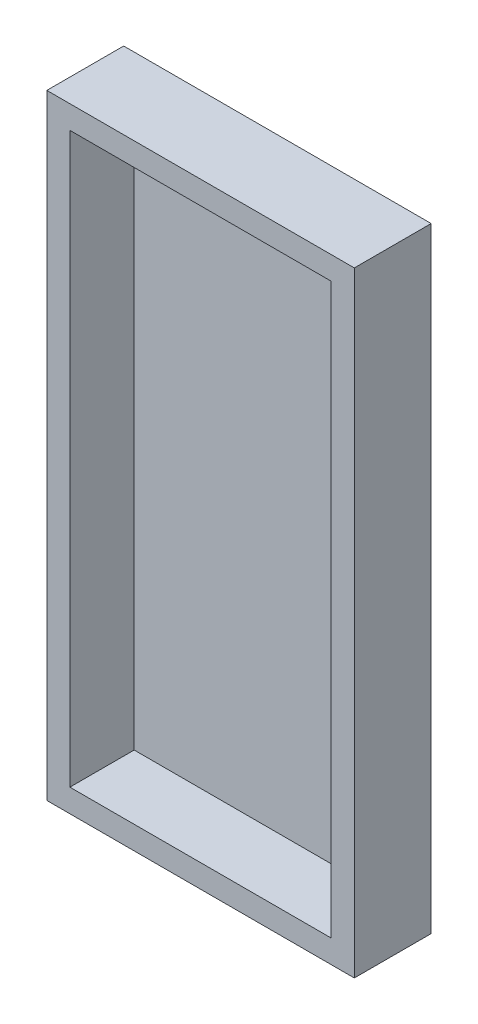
ISO-10303-21;
HEADER;
FILE_DESCRIPTION(('STEP AP214'),'2;1');
FILE_NAME('part.step','',(''),(''),'','','');
FILE_SCHEMA(('AUTOMOTIVE_DESIGN { 1 0 10303 214 1 1 1 1 }'));
ENDSEC;
DATA;
#1=APPLICATION_CONTEXT('core data for automotive mechanical design processes');
#2=APPLICATION_PROTOCOL_DEFINITION('international standard','automotive_design',2000,#1);
#3=PRODUCT_CONTEXT('',#1,'mechanical');
#4=PRODUCT('Part','Part','',(#3));
#5=PRODUCT_RELATED_PRODUCT_CATEGORY('part','',(#4));
#6=PRODUCT_DEFINITION_FORMATION('','',#4);
#7=PRODUCT_DEFINITION_CONTEXT('part definition',#1,'design');
#8=PRODUCT_DEFINITION('design','',#6,#7);
#9=PRODUCT_DEFINITION_SHAPE('','',#8);
#10=(LENGTH_UNIT() NAMED_UNIT(*) SI_UNIT(.MILLI.,.METRE.));
#11=(NAMED_UNIT(*) PLANE_ANGLE_UNIT() SI_UNIT($,.RADIAN.));
#12=(NAMED_UNIT(*) SI_UNIT($,.STERADIAN.) SOLID_ANGLE_UNIT());
#13=UNCERTAINTY_MEASURE_WITH_UNIT(LENGTH_MEASURE(1.E-05),#10,'distance_accuracy_value','');
#14=(GEOMETRIC_REPRESENTATION_CONTEXT(3) GLOBAL_UNCERTAINTY_ASSIGNED_CONTEXT((#13)) GLOBAL_UNIT_ASSIGNED_CONTEXT((#10,
#11,#12)) REPRESENTATION_CONTEXT('',''));
#15=CARTESIAN_POINT('',(0.,0.,0.));
#16=DIRECTION('',(0.,0.,1.));
#17=DIRECTION('',(1.,0.,0.));
#18=AXIS2_PLACEMENT_3D('',#15,#16,#17);
#19=CARTESIAN_POINT('',(-20.,-40.,-2.));
#20=DIRECTION('',(-1.,0.,0.));
#21=DIRECTION('',(0.,0.,1.));
#22=AXIS2_PLACEMENT_3D('',#19,#20,#21);
#23=PLANE('',#22);
#24=DIRECTION('',(0.,0.,1.));
#25=VECTOR('',#24,1.);
#26=CARTESIAN_POINT('',(-20.,-40.,-2.));
#27=LINE('',#26,#25);
#28=CARTESIAN_POINT('',(-20.,-40.,-2.));
#29=VERTEX_POINT('',#28);
#30=CARTESIAN_POINT('',(-20.,-40.,8.));
#31=VERTEX_POINT('',#30);
#32=EDGE_CURVE('E44',#29,#31,#27,.T.);
#33=ORIENTED_EDGE('',*,*,#32,.T.);
#34=DIRECTION('',(0.,-1.,0.));
#35=VECTOR('',#34,1.);
#36=CARTESIAN_POINT('',(-20.,-40.,8.));
#37=LINE('',#36,#35);
#38=CARTESIAN_POINT('',(-20.,40.,8.));
#39=VERTEX_POINT('',#38);
#40=EDGE_CURVE('E141',#39,#31,#37,.T.);
#41=ORIENTED_EDGE('',*,*,#40,.F.);
#42=DIRECTION('',(0.,0.,1.));
#43=VECTOR('',#42,1.);
#44=CARTESIAN_POINT('',(-20.,40.,-2.));
#45=LINE('',#44,#43);
#46=CARTESIAN_POINT('',(-20.,40.,-2.));
#47=VERTEX_POINT('',#46);
#48=EDGE_CURVE('E11',#47,#39,#45,.T.);
#49=ORIENTED_EDGE('',*,*,#48,.F.);
#50=DIRECTION('',(0.,-1.,0.));
#51=VECTOR('',#50,1.);
#52=CARTESIAN_POINT('',(-20.,-40.,-2.));
#53=LINE('',#52,#51);
#54=EDGE_CURVE('E156',#47,#29,#53,.T.);
#55=ORIENTED_EDGE('',*,*,#54,.T.);
#56=EDGE_LOOP('',(#33,#41,#49,#55));
#57=FACE_BOUND('',#56,.T.);
#58=ADVANCED_FACE('F41',(#57),#23,.T.);
#59=CARTESIAN_POINT('',(20.,40.,-2.));
#60=DIRECTION('',(0.,1.,0.));
#61=DIRECTION('',(0.,0.,1.));
#62=AXIS2_PLACEMENT_3D('',#59,#60,#61);
#63=PLANE('',#62);
#64=ORIENTED_EDGE('',*,*,#48,.T.);
#65=DIRECTION('',(-1.,0.,0.));
#66=VECTOR('',#65,1.);
#67=CARTESIAN_POINT('',(20.,40.,8.));
#68=LINE('',#67,#66);
#69=CARTESIAN_POINT('',(20.,40.,8.));
#70=VERTEX_POINT('',#69);
#71=EDGE_CURVE('E153',#70,#39,#68,.T.);
#72=ORIENTED_EDGE('',*,*,#71,.F.);
#73=DIRECTION('',(0.,0.,1.));
#74=VECTOR('',#73,1.);
#75=CARTESIAN_POINT('',(20.,40.,-2.));
#76=LINE('',#75,#74);
#77=CARTESIAN_POINT('',(20.,40.,-2.));
#78=VERTEX_POINT('',#77);
#79=EDGE_CURVE('E49',#78,#70,#76,.T.);
#80=ORIENTED_EDGE('',*,*,#79,.F.);
#81=DIRECTION('',(-1.,0.,0.));
#82=VECTOR('',#81,1.);
#83=CARTESIAN_POINT('',(20.,40.,-2.));
#84=LINE('',#83,#82);
#85=EDGE_CURVE('E164',#78,#47,#84,.T.);
#86=ORIENTED_EDGE('',*,*,#85,.T.);
#87=EDGE_LOOP('',(#64,#72,#80,#86));
#88=FACE_BOUND('',#87,.T.);
#89=ADVANCED_FACE('F177',(#88),#63,.T.);
#90=CARTESIAN_POINT('',(20.,-40.,-2.));
#91=DIRECTION('',(1.,0.,0.));
#92=DIRECTION('',(0.,0.,-1.));
#93=AXIS2_PLACEMENT_3D('',#90,#91,#92);
#94=PLANE('',#93);
#95=ORIENTED_EDGE('',*,*,#79,.T.);
#96=DIRECTION('',(0.,1.,0.));
#97=VECTOR('',#96,1.);
#98=CARTESIAN_POINT('',(20.,-40.,8.));
#99=LINE('',#98,#97);
#100=CARTESIAN_POINT('',(20.,-40.,8.));
#101=VERTEX_POINT('',#100);
#102=EDGE_CURVE('E150',#101,#70,#99,.T.);
#103=ORIENTED_EDGE('',*,*,#102,.F.);
#104=DIRECTION('',(0.,0.,1.));
#105=VECTOR('',#104,1.);
#106=CARTESIAN_POINT('',(20.,-40.,-2.));
#107=LINE('',#106,#105);
#108=CARTESIAN_POINT('',(20.,-40.,-2.));
#109=VERTEX_POINT('',#108);
#110=EDGE_CURVE('E167',#109,#101,#107,.T.);
#111=ORIENTED_EDGE('',*,*,#110,.F.);
#112=DIRECTION('',(0.,1.,0.));
#113=VECTOR('',#112,1.);
#114=CARTESIAN_POINT('',(20.,-40.,-2.));
#115=LINE('',#114,#113);
#116=EDGE_CURVE('E161',#109,#78,#115,.T.);
#117=ORIENTED_EDGE('',*,*,#116,.T.);
#118=EDGE_LOOP('',(#95,#103,#111,#117));
#119=FACE_BOUND('',#118,.T.);
#120=ADVANCED_FACE('F183',(#119),#94,.T.);
#121=CARTESIAN_POINT('',(20.,-40.,-2.));
#122=DIRECTION('',(0.,-1.,0.));
#123=DIRECTION('',(1.,0.,0.));
#124=AXIS2_PLACEMENT_3D('',#121,#122,#123);
#125=PLANE('',#124);
#126=ORIENTED_EDGE('',*,*,#110,.T.);
#127=DIRECTION('',(1.,0.,0.));
#128=VECTOR('',#127,1.);
#129=CARTESIAN_POINT('',(20.,-40.,8.));
#130=LINE('',#129,#128);
#131=EDGE_CURVE('E147',#31,#101,#130,.T.);
#132=ORIENTED_EDGE('',*,*,#131,.F.);
#133=ORIENTED_EDGE('',*,*,#32,.F.);
#134=DIRECTION('',(1.,0.,0.));
#135=VECTOR('',#134,1.);
#136=CARTESIAN_POINT('',(20.,-40.,-2.));
#137=LINE('',#136,#135);
#138=EDGE_CURVE('E158',#29,#109,#137,.T.);
#139=ORIENTED_EDGE('',*,*,#138,.T.);
#140=EDGE_LOOP('',(#126,#132,#133,#139));
#141=FACE_BOUND('',#140,.T.);
#142=ADVANCED_FACE('F171',(#141),#125,.T.);
#143=CARTESIAN_POINT('',(0.,0.,-2.));
#144=DIRECTION('',(0.,0.,1.));
#145=DIRECTION('',(1.,0.,0.));
#146=AXIS2_PLACEMENT_3D('',#143,#144,#145);
#147=PLANE('',#146);
#148=ORIENTED_EDGE('',*,*,#54,.F.);
#149=ORIENTED_EDGE('',*,*,#85,.F.);
#150=ORIENTED_EDGE('',*,*,#116,.F.);
#151=ORIENTED_EDGE('',*,*,#138,.F.);
#152=EDGE_LOOP('',(#148,#149,#150,#151));
#153=FACE_BOUND('',#152,.T.);
#154=ADVANCED_FACE('F181',(#153),#147,.F.);
#155=CARTESIAN_POINT('',(0.,0.,8.));
#156=DIRECTION('',(0.,0.,1.));
#157=DIRECTION('',(1.,0.,0.));
#158=AXIS2_PLACEMENT_3D('',#155,#156,#157);
#159=PLANE('',#158);
#160=DIRECTION('',(0.,-1.,0.));
#161=VECTOR('',#160,1.);
#162=CARTESIAN_POINT('',(-17.,-37.,8.));
#163=LINE('',#162,#161);
#164=CARTESIAN_POINT('',(-17.,37.,8.));
#165=VERTEX_POINT('',#164);
#166=CARTESIAN_POINT('',(-17.,-37.,8.));
#167=VERTEX_POINT('',#166);
#168=EDGE_CURVE('E57',#165,#167,#163,.T.);
#169=ORIENTED_EDGE('',*,*,#168,.F.);
#170=DIRECTION('',(-1.,0.,0.));
#171=VECTOR('',#170,1.);
#172=CARTESIAN_POINT('',(17.,37.,8.));
#173=LINE('',#172,#171);
#174=CARTESIAN_POINT('',(17.,37.,8.));
#175=VERTEX_POINT('',#174);
#176=EDGE_CURVE('E126',#175,#165,#173,.T.);
#177=ORIENTED_EDGE('',*,*,#176,.F.);
#178=DIRECTION('',(0.,1.,0.));
#179=VECTOR('',#178,1.);
#180=CARTESIAN_POINT('',(17.,-37.,8.));
#181=LINE('',#180,#179);
#182=CARTESIAN_POINT('',(17.,-37.,8.));
#183=VERTEX_POINT('',#182);
#184=EDGE_CURVE('E129',#183,#175,#181,.T.);
#185=ORIENTED_EDGE('',*,*,#184,.F.);
#186=DIRECTION('',(1.,0.,0.));
#187=VECTOR('',#186,1.);
#188=CARTESIAN_POINT('',(17.,-37.,8.));
#189=LINE('',#188,#187);
#190=EDGE_CURVE('E135',#167,#183,#189,.T.);
#191=ORIENTED_EDGE('',*,*,#190,.F.);
#192=EDGE_LOOP('',(#169,#177,#185,#191));
#193=FACE_BOUND('',#192,.T.);
#194=ORIENTED_EDGE('',*,*,#40,.T.);
#195=ORIENTED_EDGE('',*,*,#131,.T.);
#196=ORIENTED_EDGE('',*,*,#102,.T.);
#197=ORIENTED_EDGE('',*,*,#71,.T.);
#198=EDGE_LOOP('',(#194,#195,#196,#197));
#199=FACE_BOUND('',#198,.T.);
#200=ADVANCED_FACE('F174',(#193,#199),#159,.T.);
#201=CARTESIAN_POINT('',(-17.,-37.,-0.363170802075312));
#202=DIRECTION('',(-1.,0.,0.));
#203=DIRECTION('',(0.,0.,1.));
#204=AXIS2_PLACEMENT_3D('',#201,#202,#203);
#205=PLANE('',#204);
#206=ORIENTED_EDGE('',*,*,#168,.T.);
#207=DIRECTION('',(0.,0.,1.));
#208=VECTOR('',#207,1.);
#209=CARTESIAN_POINT('',(-17.,-37.,-0.363170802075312));
#210=LINE('',#209,#208);
#211=CARTESIAN_POINT('',(-17.,-37.,-0.363170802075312));
#212=VERTEX_POINT('',#211);
#213=EDGE_CURVE('E104',#212,#167,#210,.T.);
#214=ORIENTED_EDGE('',*,*,#213,.F.);
#215=DIRECTION('',(0.,-1.,0.));
#216=VECTOR('',#215,1.);
#217=CARTESIAN_POINT('',(-17.,-37.,-0.363170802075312));
#218=LINE('',#217,#216);
#219=CARTESIAN_POINT('',(-17.,37.,-0.363170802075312));
#220=VERTEX_POINT('',#219);
#221=EDGE_CURVE('E108',#220,#212,#218,.T.);
#222=ORIENTED_EDGE('',*,*,#221,.F.);
#223=DIRECTION('',(0.,0.,1.));
#224=VECTOR('',#223,1.);
#225=CARTESIAN_POINT('',(-17.,37.,-0.363170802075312));
#226=LINE('',#225,#224);
#227=EDGE_CURVE('E139',#220,#165,#226,.T.);
#228=ORIENTED_EDGE('',*,*,#227,.T.);
#229=EDGE_LOOP('',(#206,#214,#222,#228));
#230=FACE_BOUND('',#229,.T.);
#231=ADVANCED_FACE('F106',(#230),#205,.F.);
#232=CARTESIAN_POINT('',(17.,37.,-0.363170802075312));
#233=DIRECTION('',(0.,1.,0.));
#234=DIRECTION('',(0.,0.,1.));
#235=AXIS2_PLACEMENT_3D('',#232,#233,#234);
#236=PLANE('',#235);
#237=ORIENTED_EDGE('',*,*,#176,.T.);
#238=ORIENTED_EDGE('',*,*,#227,.F.);
#239=DIRECTION('',(-1.,0.,0.));
#240=VECTOR('',#239,1.);
#241=CARTESIAN_POINT('',(17.,37.,-0.363170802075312));
#242=LINE('',#241,#240);
#243=CARTESIAN_POINT('',(17.,37.,-0.363170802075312));
#244=VERTEX_POINT('',#243);
#245=EDGE_CURVE('E114',#244,#220,#242,.T.);
#246=ORIENTED_EDGE('',*,*,#245,.F.);
#247=DIRECTION('',(0.,0.,1.));
#248=VECTOR('',#247,1.);
#249=CARTESIAN_POINT('',(17.,37.,-0.363170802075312));
#250=LINE('',#249,#248);
#251=EDGE_CURVE('E142',#244,#175,#250,.T.);
#252=ORIENTED_EDGE('',*,*,#251,.T.);
#253=EDGE_LOOP('',(#237,#238,#246,#252));
#254=FACE_BOUND('',#253,.T.);
#255=ADVANCED_FACE('F239',(#254),#236,.F.);
#256=CARTESIAN_POINT('',(17.,-37.,-0.363170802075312));
#257=DIRECTION('',(1.,0.,0.));
#258=DIRECTION('',(0.,0.,-1.));
#259=AXIS2_PLACEMENT_3D('',#256,#257,#258);
#260=PLANE('',#259);
#261=ORIENTED_EDGE('',*,*,#184,.T.);
#262=ORIENTED_EDGE('',*,*,#251,.F.);
#263=DIRECTION('',(0.,1.,0.));
#264=VECTOR('',#263,1.);
#265=CARTESIAN_POINT('',(17.,-37.,-0.363170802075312));
#266=LINE('',#265,#264);
#267=CARTESIAN_POINT('',(17.,-37.,-0.363170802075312));
#268=VERTEX_POINT('',#267);
#269=EDGE_CURVE('E122',#268,#244,#266,.T.);
#270=ORIENTED_EDGE('',*,*,#269,.F.);
#271=DIRECTION('',(0.,0.,1.));
#272=VECTOR('',#271,1.);
#273=CARTESIAN_POINT('',(17.,-37.,-0.363170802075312));
#274=LINE('',#273,#272);
#275=EDGE_CURVE('E113',#268,#183,#274,.T.);
#276=ORIENTED_EDGE('',*,*,#275,.T.);
#277=EDGE_LOOP('',(#261,#262,#270,#276));
#278=FACE_BOUND('',#277,.T.);
#279=ADVANCED_FACE('F249',(#278),#260,.F.);
#280=CARTESIAN_POINT('',(17.,-37.,-0.363170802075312));
#281=DIRECTION('',(0.,-1.,0.));
#282=DIRECTION('',(0.,0.,-1.));
#283=AXIS2_PLACEMENT_3D('',#280,#281,#282);
#284=PLANE('',#283);
#285=ORIENTED_EDGE('',*,*,#190,.T.);
#286=ORIENTED_EDGE('',*,*,#275,.F.);
#287=DIRECTION('',(1.,0.,0.));
#288=VECTOR('',#287,1.);
#289=CARTESIAN_POINT('',(17.,-37.,-0.363170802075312));
#290=LINE('',#289,#288);
#291=EDGE_CURVE('E117',#212,#268,#290,.T.);
#292=ORIENTED_EDGE('',*,*,#291,.F.);
#293=ORIENTED_EDGE('',*,*,#213,.T.);
#294=EDGE_LOOP('',(#285,#286,#292,#293));
#295=FACE_BOUND('',#294,.T.);
#296=ADVANCED_FACE('F118',(#295),#284,.F.);
#297=CARTESIAN_POINT('',(0.,0.,-0.363170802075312));
#298=DIRECTION('',(0.,0.,1.));
#299=DIRECTION('',(1.,0.,0.));
#300=AXIS2_PLACEMENT_3D('',#297,#298,#299);
#301=PLANE('',#300);
#302=ORIENTED_EDGE('',*,*,#221,.T.);
#303=ORIENTED_EDGE('',*,*,#291,.T.);
#304=ORIENTED_EDGE('',*,*,#269,.T.);
#305=ORIENTED_EDGE('',*,*,#245,.T.);
#306=EDGE_LOOP('',(#302,#303,#304,#305));
#307=FACE_BOUND('',#306,.T.);
#308=ADVANCED_FACE('F124',(#307),#301,.T.);
#309=CLOSED_SHELL('',(#58,#89,#120,#142,#154,#200,#231,#255,#279,#296,#308));
#310=MANIFOLD_SOLID_BREP('B2',#309);
#311=ADVANCED_BREP_SHAPE_REPRESENTATION('',(#18,#310),#14);
#312=SHAPE_DEFINITION_REPRESENTATION(#9,#311);
ENDSEC;
END-ISO-10303-21;
